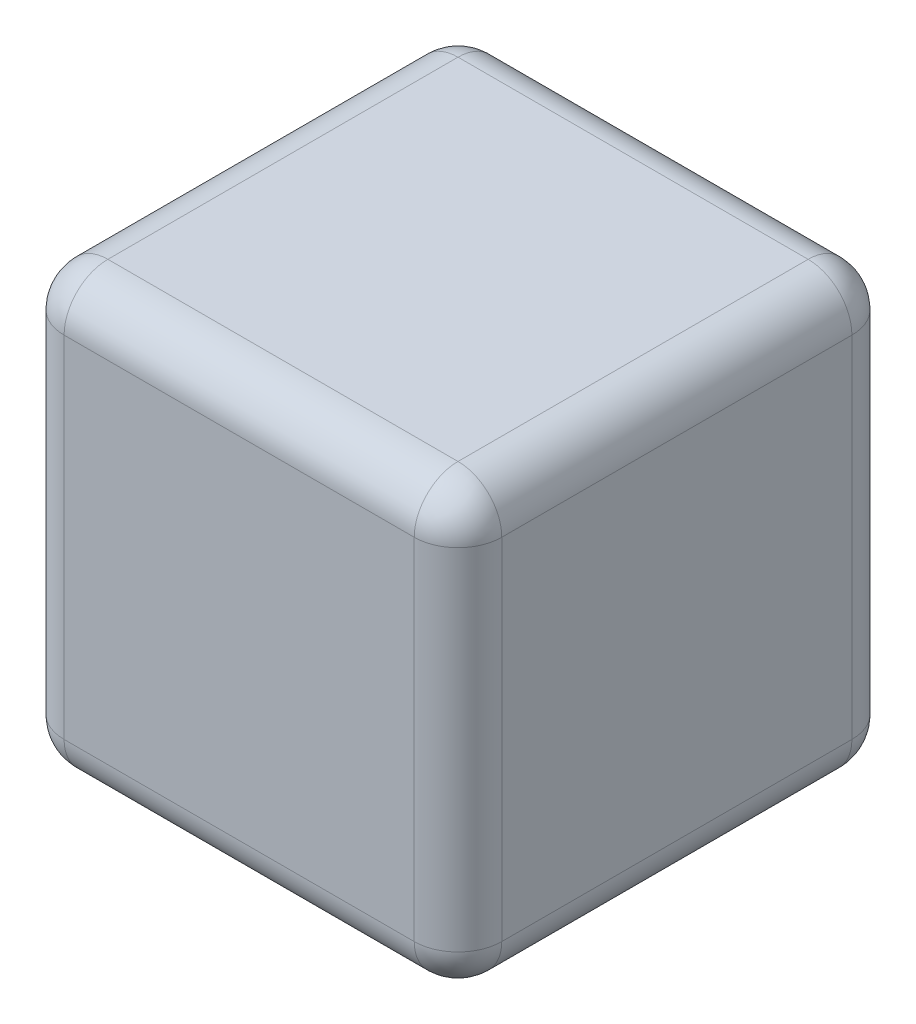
ISO-10303-21;
HEADER;
FILE_DESCRIPTION(('STEP AP214'),'2;1');
FILE_NAME('part.step','',(''),(''),'','','');
FILE_SCHEMA(('AUTOMOTIVE_DESIGN { 1 0 10303 214 1 1 1 1 }'));
ENDSEC;
DATA;
#1=APPLICATION_CONTEXT('core data for automotive mechanical design processes');
#2=APPLICATION_PROTOCOL_DEFINITION('international standard','automotive_design',2000,#1);
#3=PRODUCT_CONTEXT('',#1,'mechanical');
#4=PRODUCT('Part','Part','',(#3));
#5=PRODUCT_RELATED_PRODUCT_CATEGORY('part','',(#4));
#6=PRODUCT_DEFINITION_FORMATION('','',#4);
#7=PRODUCT_DEFINITION_CONTEXT('part definition',#1,'design');
#8=PRODUCT_DEFINITION('design','',#6,#7);
#9=PRODUCT_DEFINITION_SHAPE('','',#8);
#10=(LENGTH_UNIT() NAMED_UNIT(*) SI_UNIT(.MILLI.,.METRE.));
#11=(NAMED_UNIT(*) PLANE_ANGLE_UNIT() SI_UNIT($,.RADIAN.));
#12=(NAMED_UNIT(*) SI_UNIT($,.STERADIAN.) SOLID_ANGLE_UNIT());
#13=UNCERTAINTY_MEASURE_WITH_UNIT(LENGTH_MEASURE(1.E-05),#10,'distance_accuracy_value','');
#14=(GEOMETRIC_REPRESENTATION_CONTEXT(3) GLOBAL_UNCERTAINTY_ASSIGNED_CONTEXT((#13)) GLOBAL_UNIT_ASSIGNED_CONTEXT((#10,
#11,#12)) REPRESENTATION_CONTEXT('',''));
#15=CARTESIAN_POINT('',(0.,0.,0.));
#16=DIRECTION('',(0.,0.,1.));
#17=DIRECTION('',(1.,0.,0.));
#18=AXIS2_PLACEMENT_3D('',#15,#16,#17);
#19=CARTESIAN_POINT('',(2.5,5.,-2.5));
#20=DIRECTION('',(-1.,0.,0.));
#21=DIRECTION('',(0.,0.,1.));
#22=AXIS2_PLACEMENT_3D('',#19,#20,#21);
#23=PLANE('',#22);
#24=DIRECTION('',(0.,0.,-1.));
#25=VECTOR('',#24,1.);
#26=CARTESIAN_POINT('',(2.5,0.5,-2.5));
#27=LINE('',#26,#25);
#28=CARTESIAN_POINT('',(2.5,0.5,2.));
#29=VERTEX_POINT('',#28);
#30=CARTESIAN_POINT('',(2.5,0.5,-2.));
#31=VERTEX_POINT('',#30);
#32=EDGE_CURVE('E169',#29,#31,#27,.T.);
#33=ORIENTED_EDGE('',*,*,#32,.T.);
#34=DIRECTION('',(0.,-1.,0.));
#35=VECTOR('',#34,1.);
#36=CARTESIAN_POINT('',(2.5,5.,-2.));
#37=LINE('',#36,#35);
#38=CARTESIAN_POINT('',(2.5,4.5,-2.));
#39=VERTEX_POINT('',#38);
#40=EDGE_CURVE('E171',#31,#39,#37,.F.);
#41=ORIENTED_EDGE('',*,*,#40,.T.);
#42=DIRECTION('',(0.,0.,-1.));
#43=VECTOR('',#42,1.);
#44=CARTESIAN_POINT('',(2.5,4.5,2.5));
#45=LINE('',#44,#43);
#46=CARTESIAN_POINT('',(2.5,4.5,2.));
#47=VERTEX_POINT('',#46);
#48=EDGE_CURVE('E165',#39,#47,#45,.F.);
#49=ORIENTED_EDGE('',*,*,#48,.T.);
#50=DIRECTION('',(0.,-1.,0.));
#51=VECTOR('',#50,1.);
#52=CARTESIAN_POINT('',(2.5,5.,2.));
#53=LINE('',#52,#51);
#54=EDGE_CURVE('E167',#47,#29,#53,.T.);
#55=ORIENTED_EDGE('',*,*,#54,.T.);
#56=EDGE_LOOP('',(#33,#41,#49,#55));
#57=FACE_BOUND('',#56,.T.);
#58=ADVANCED_FACE('F34',(#57),#23,.F.);
#59=CARTESIAN_POINT('',(-2.5,5.,-2.5));
#60=DIRECTION('',(0.,0.,1.));
#61=DIRECTION('',(1.,0.,0.));
#62=AXIS2_PLACEMENT_3D('',#59,#60,#61);
#63=PLANE('',#62);
#64=DIRECTION('',(0.,-1.,0.));
#65=VECTOR('',#64,1.);
#66=CARTESIAN_POINT('',(2.,5.,-2.5));
#67=LINE('',#66,#65);
#68=CARTESIAN_POINT('',(2.,4.5,-2.5));
#69=VERTEX_POINT('',#68);
#70=CARTESIAN_POINT('',(2.,0.5,-2.5));
#71=VERTEX_POINT('',#70);
#72=EDGE_CURVE('E133',#69,#71,#67,.T.);
#73=ORIENTED_EDGE('',*,*,#72,.T.);
#74=DIRECTION('',(-1.,0.,0.));
#75=VECTOR('',#74,1.);
#76=CARTESIAN_POINT('',(-2.5,0.5,-2.5));
#77=LINE('',#76,#75);
#78=CARTESIAN_POINT('',(-2.,0.5,-2.5));
#79=VERTEX_POINT('',#78);
#80=EDGE_CURVE('E129',#71,#79,#77,.T.);
#81=ORIENTED_EDGE('',*,*,#80,.T.);
#82=DIRECTION('',(0.,-1.,0.));
#83=VECTOR('',#82,1.);
#84=CARTESIAN_POINT('',(-2.,5.,-2.5));
#85=LINE('',#84,#83);
#86=CARTESIAN_POINT('',(-2.,4.5,-2.5));
#87=VERTEX_POINT('',#86);
#88=EDGE_CURVE('E121',#79,#87,#85,.F.);
#89=ORIENTED_EDGE('',*,*,#88,.T.);
#90=DIRECTION('',(-1.,0.,0.));
#91=VECTOR('',#90,1.);
#92=CARTESIAN_POINT('',(2.5,4.5,-2.5));
#93=LINE('',#92,#91);
#94=EDGE_CURVE('E126',#87,#69,#93,.F.);
#95=ORIENTED_EDGE('',*,*,#94,.T.);
#96=EDGE_LOOP('',(#73,#81,#89,#95));
#97=FACE_BOUND('',#96,.T.);
#98=ADVANCED_FACE('F124',(#97),#63,.F.);
#99=CARTESIAN_POINT('',(-2.5,5.,-2.5));
#100=DIRECTION('',(1.,0.,0.));
#101=DIRECTION('',(0.,0.,-1.));
#102=AXIS2_PLACEMENT_3D('',#99,#100,#101);
#103=PLANE('',#102);
#104=DIRECTION('',(0.,0.,1.));
#105=VECTOR('',#104,1.);
#106=CARTESIAN_POINT('',(-2.5,4.5,-2.5));
#107=LINE('',#106,#105);
#108=CARTESIAN_POINT('',(-2.5,4.5,2.));
#109=VERTEX_POINT('',#108);
#110=CARTESIAN_POINT('',(-2.5,4.5,-2.));
#111=VERTEX_POINT('',#110);
#112=EDGE_CURVE('E174',#109,#111,#107,.F.);
#113=ORIENTED_EDGE('',*,*,#112,.T.);
#114=DIRECTION('',(0.,-1.,0.));
#115=VECTOR('',#114,1.);
#116=CARTESIAN_POINT('',(-2.5,5.,-2.));
#117=LINE('',#116,#115);
#118=CARTESIAN_POINT('',(-2.5,0.5,-2.));
#119=VERTEX_POINT('',#118);
#120=EDGE_CURVE('E141',#111,#119,#117,.T.);
#121=ORIENTED_EDGE('',*,*,#120,.T.);
#122=DIRECTION('',(0.,0.,1.));
#123=VECTOR('',#122,1.);
#124=CARTESIAN_POINT('',(-2.5,0.5,-2.5));
#125=LINE('',#124,#123);
#126=CARTESIAN_POINT('',(-2.5,0.5,2.));
#127=VERTEX_POINT('',#126);
#128=EDGE_CURVE('E178',#119,#127,#125,.T.);
#129=ORIENTED_EDGE('',*,*,#128,.T.);
#130=DIRECTION('',(0.,-1.,0.));
#131=VECTOR('',#130,1.);
#132=CARTESIAN_POINT('',(-2.5,5.,2.));
#133=LINE('',#132,#131);
#134=EDGE_CURVE('E176',#127,#109,#133,.F.);
#135=ORIENTED_EDGE('',*,*,#134,.T.);
#136=EDGE_LOOP('',(#113,#121,#129,#135));
#137=FACE_BOUND('',#136,.T.);
#138=ADVANCED_FACE('F298',(#137),#103,.F.);
#139=CARTESIAN_POINT('',(-2.5,5.,2.5));
#140=DIRECTION('',(0.,0.,-1.));
#141=DIRECTION('',(-1.,0.,0.));
#142=AXIS2_PLACEMENT_3D('',#139,#140,#141);
#143=PLANE('',#142);
#144=DIRECTION('',(1.,0.,0.));
#145=VECTOR('',#144,1.);
#146=CARTESIAN_POINT('',(-2.5,4.5,2.5));
#147=LINE('',#146,#145);
#148=CARTESIAN_POINT('',(2.,4.5,2.5));
#149=VERTEX_POINT('',#148);
#150=CARTESIAN_POINT('',(-2.,4.5,2.5));
#151=VERTEX_POINT('',#150);
#152=EDGE_CURVE('E190',#149,#151,#147,.F.);
#153=ORIENTED_EDGE('',*,*,#152,.T.);
#154=DIRECTION('',(0.,-1.,0.));
#155=VECTOR('',#154,1.);
#156=CARTESIAN_POINT('',(-2.,5.,2.5));
#157=LINE('',#156,#155);
#158=CARTESIAN_POINT('',(-2.,0.5,2.5));
#159=VERTEX_POINT('',#158);
#160=EDGE_CURVE('E196',#151,#159,#157,.T.);
#161=ORIENTED_EDGE('',*,*,#160,.T.);
#162=DIRECTION('',(1.,0.,0.));
#163=VECTOR('',#162,1.);
#164=CARTESIAN_POINT('',(-2.5,0.5,2.5));
#165=LINE('',#164,#163);
#166=CARTESIAN_POINT('',(2.,0.5,2.5));
#167=VERTEX_POINT('',#166);
#168=EDGE_CURVE('E194',#159,#167,#165,.T.);
#169=ORIENTED_EDGE('',*,*,#168,.T.);
#170=DIRECTION('',(0.,-1.,0.));
#171=VECTOR('',#170,1.);
#172=CARTESIAN_POINT('',(2.,5.,2.5));
#173=LINE('',#172,#171);
#174=EDGE_CURVE('E192',#167,#149,#173,.F.);
#175=ORIENTED_EDGE('',*,*,#174,.T.);
#176=EDGE_LOOP('',(#153,#161,#169,#175));
#177=FACE_BOUND('',#176,.T.);
#178=ADVANCED_FACE('F275',(#177),#143,.F.);
#179=CARTESIAN_POINT('',(0.,5.,0.));
#180=DIRECTION('',(0.,1.,0.));
#181=DIRECTION('',(0.,0.,1.));
#182=AXIS2_PLACEMENT_3D('',#179,#180,#181);
#183=PLANE('',#182);
#184=DIRECTION('',(-1.,0.,0.));
#185=VECTOR('',#184,1.);
#186=CARTESIAN_POINT('',(-2.5,5.,-2.));
#187=LINE('',#186,#185);
#188=CARTESIAN_POINT('',(2.,5.,-2.));
#189=VERTEX_POINT('',#188);
#190=CARTESIAN_POINT('',(-2.,5.,-2.));
#191=VERTEX_POINT('',#190);
#192=EDGE_CURVE('E43',#189,#191,#187,.T.);
#193=ORIENTED_EDGE('',*,*,#192,.T.);
#194=DIRECTION('',(0.,0.,1.));
#195=VECTOR('',#194,1.);
#196=CARTESIAN_POINT('',(-2.,5.,2.5));
#197=LINE('',#196,#195);
#198=CARTESIAN_POINT('',(-2.,5.,2.));
#199=VERTEX_POINT('',#198);
#200=EDGE_CURVE('E11',#191,#199,#197,.T.);
#201=ORIENTED_EDGE('',*,*,#200,.T.);
#202=DIRECTION('',(1.,0.,0.));
#203=VECTOR('',#202,1.);
#204=CARTESIAN_POINT('',(2.5,5.,2.));
#205=LINE('',#204,#203);
#206=CARTESIAN_POINT('',(2.,5.,2.));
#207=VERTEX_POINT('',#206);
#208=EDGE_CURVE('E199',#199,#207,#205,.T.);
#209=ORIENTED_EDGE('',*,*,#208,.T.);
#210=DIRECTION('',(0.,0.,-1.));
#211=VECTOR('',#210,1.);
#212=CARTESIAN_POINT('',(2.,5.,-2.5));
#213=LINE('',#212,#211);
#214=EDGE_CURVE('E54',#207,#189,#213,.T.);
#215=ORIENTED_EDGE('',*,*,#214,.T.);
#216=EDGE_LOOP('',(#193,#201,#209,#215));
#217=FACE_BOUND('',#216,.T.);
#218=ADVANCED_FACE('F305',(#217),#183,.T.);
#219=CARTESIAN_POINT('',(0.,0.,0.));
#220=DIRECTION('',(0.,1.,0.));
#221=DIRECTION('',(0.,0.,1.));
#222=AXIS2_PLACEMENT_3D('',#219,#220,#221);
#223=PLANE('',#222);
#224=DIRECTION('',(0.,0.,1.));
#225=VECTOR('',#224,1.);
#226=CARTESIAN_POINT('',(-2.,0.,0.));
#227=LINE('',#226,#225);
#228=CARTESIAN_POINT('',(-2.,0.,2.));
#229=VERTEX_POINT('',#228);
#230=CARTESIAN_POINT('',(-2.,0.,-2.));
#231=VERTEX_POINT('',#230);
#232=EDGE_CURVE('E185',#229,#231,#227,.F.);
#233=ORIENTED_EDGE('',*,*,#232,.T.);
#234=DIRECTION('',(-1.,0.,0.));
#235=VECTOR('',#234,1.);
#236=CARTESIAN_POINT('',(0.,0.,-2.));
#237=LINE('',#236,#235);
#238=CARTESIAN_POINT('',(2.,0.,-2.));
#239=VERTEX_POINT('',#238);
#240=EDGE_CURVE('E187',#231,#239,#237,.F.);
#241=ORIENTED_EDGE('',*,*,#240,.T.);
#242=DIRECTION('',(0.,0.,-1.));
#243=VECTOR('',#242,1.);
#244=CARTESIAN_POINT('',(2.,0.,0.));
#245=LINE('',#244,#243);
#246=CARTESIAN_POINT('',(2.,0.,2.));
#247=VERTEX_POINT('',#246);
#248=EDGE_CURVE('E183',#239,#247,#245,.F.);
#249=ORIENTED_EDGE('',*,*,#248,.T.);
#250=DIRECTION('',(1.,0.,0.));
#251=VECTOR('',#250,1.);
#252=CARTESIAN_POINT('',(0.,0.,2.));
#253=LINE('',#252,#251);
#254=EDGE_CURVE('E181',#247,#229,#253,.F.);
#255=ORIENTED_EDGE('',*,*,#254,.T.);
#256=EDGE_LOOP('',(#233,#241,#249,#255));
#257=FACE_BOUND('',#256,.T.);
#258=ADVANCED_FACE('F266',(#257),#223,.F.);
#259=CARTESIAN_POINT('',(-2.,5.,2.));
#260=DIRECTION('',(0.,-1.,0.));
#261=DIRECTION('',(0.,0.,-1.));
#262=AXIS2_PLACEMENT_3D('',#259,#260,#261);
#263=CYLINDRICAL_SURFACE('',#262,0.5);
#264=CARTESIAN_POINT('',(-2.,4.5,2.));
#265=DIRECTION('',(0.,1.,0.));
#266=DIRECTION('',(0.,0.,1.));
#267=AXIS2_PLACEMENT_3D('',#264,#265,#266);
#268=CIRCLE('',#267,0.5);
#269=EDGE_CURVE('E38',#109,#151,#268,.T.);
#270=ORIENTED_EDGE('',*,*,#269,.F.);
#271=ORIENTED_EDGE('',*,*,#134,.F.);
#272=CARTESIAN_POINT('',(-2.,0.5,2.));
#273=DIRECTION('',(0.,-1.,0.));
#274=DIRECTION('',(0.,0.,-1.));
#275=AXIS2_PLACEMENT_3D('',#272,#273,#274);
#276=CIRCLE('',#275,0.5);
#277=EDGE_CURVE('E161',#159,#127,#276,.T.);
#278=ORIENTED_EDGE('',*,*,#277,.F.);
#279=ORIENTED_EDGE('',*,*,#160,.F.);
#280=EDGE_LOOP('',(#270,#271,#278,#279));
#281=FACE_BOUND('',#280,.T.);
#282=ADVANCED_FACE('F36',(#281),#263,.T.);
#283=CARTESIAN_POINT('',(-2.,4.5,2.));
#284=DIRECTION('',(0.,0.,1.));
#285=DIRECTION('',(1.,0.,0.));
#286=AXIS2_PLACEMENT_3D('',#283,#284,#285);
#287=SPHERICAL_SURFACE('',#286,0.5);
#288=CARTESIAN_POINT('',(-2.,4.5,2.));
#289=DIRECTION('',(0.,0.,1.));
#290=DIRECTION('',(1.,0.,0.));
#291=AXIS2_PLACEMENT_3D('',#288,#289,#290);
#292=CIRCLE('',#291,0.5);
#293=EDGE_CURVE('E245',#109,#199,#292,.F.);
#294=ORIENTED_EDGE('',*,*,#293,.F.);
#295=ORIENTED_EDGE('',*,*,#269,.T.);
#296=CARTESIAN_POINT('',(-2.,4.5,2.));
#297=DIRECTION('',(-1.,0.,0.));
#298=DIRECTION('',(0.,0.,1.));
#299=AXIS2_PLACEMENT_3D('',#296,#297,#298);
#300=CIRCLE('',#299,0.5);
#301=EDGE_CURVE('E248',#199,#151,#300,.F.);
#302=ORIENTED_EDGE('',*,*,#301,.F.);
#303=EDGE_LOOP('',(#294,#295,#302));
#304=FACE_BOUND('',#303,.T.);
#305=ADVANCED_FACE('F293',(#304),#287,.T.);
#306=CARTESIAN_POINT('',(-2.,0.5,2.));
#307=DIRECTION('',(0.,0.,1.));
#308=DIRECTION('',(1.,0.,0.));
#309=AXIS2_PLACEMENT_3D('',#306,#307,#308);
#310=SPHERICAL_SURFACE('',#309,0.5);
#311=CARTESIAN_POINT('',(-2.,0.5,2.));
#312=DIRECTION('',(-1.,0.,0.));
#313=DIRECTION('',(0.,0.,1.));
#314=AXIS2_PLACEMENT_3D('',#311,#312,#313);
#315=CIRCLE('',#314,0.5);
#316=EDGE_CURVE('E239',#159,#229,#315,.F.);
#317=ORIENTED_EDGE('',*,*,#316,.F.);
#318=ORIENTED_EDGE('',*,*,#277,.T.);
#319=CARTESIAN_POINT('',(-2.,0.5,2.));
#320=DIRECTION('',(0.,0.,1.));
#321=DIRECTION('',(1.,0.,0.));
#322=AXIS2_PLACEMENT_3D('',#319,#320,#321);
#323=CIRCLE('',#322,0.5);
#324=EDGE_CURVE('E242',#229,#127,#323,.F.);
#325=ORIENTED_EDGE('',*,*,#324,.F.);
#326=EDGE_LOOP('',(#317,#318,#325));
#327=FACE_BOUND('',#326,.T.);
#328=ADVANCED_FACE('F255',(#327),#310,.T.);
#329=CARTESIAN_POINT('',(0.,4.5,2.));
#330=DIRECTION('',(-1.,0.,0.));
#331=DIRECTION('',(0.,0.,1.));
#332=AXIS2_PLACEMENT_3D('',#329,#330,#331);
#333=CYLINDRICAL_SURFACE('',#332,0.5);
#334=ORIENTED_EDGE('',*,*,#301,.T.);
#335=ORIENTED_EDGE('',*,*,#152,.F.);
#336=CARTESIAN_POINT('',(2.,4.5,2.));
#337=DIRECTION('',(1.,0.,0.));
#338=DIRECTION('',(0.,0.,-1.));
#339=AXIS2_PLACEMENT_3D('',#336,#337,#338);
#340=CIRCLE('',#339,0.5);
#341=EDGE_CURVE('E233',#207,#149,#340,.T.);
#342=ORIENTED_EDGE('',*,*,#341,.F.);
#343=ORIENTED_EDGE('',*,*,#208,.F.);
#344=EDGE_LOOP('',(#334,#335,#342,#343));
#345=FACE_BOUND('',#344,.T.);
#346=ADVANCED_FACE('F288',(#345),#333,.T.);
#347=CARTESIAN_POINT('',(-2.,4.5,0.));
#348=DIRECTION('',(0.,0.,-1.));
#349=DIRECTION('',(-1.,0.,0.));
#350=AXIS2_PLACEMENT_3D('',#347,#348,#349);
#351=CYLINDRICAL_SURFACE('',#350,0.5);
#352=ORIENTED_EDGE('',*,*,#293,.T.);
#353=ORIENTED_EDGE('',*,*,#200,.F.);
#354=CARTESIAN_POINT('',(-2.,4.5,-2.));
#355=DIRECTION('',(0.,0.,-1.));
#356=DIRECTION('',(-1.,0.,0.));
#357=AXIS2_PLACEMENT_3D('',#354,#355,#356);
#358=CIRCLE('',#357,0.5);
#359=EDGE_CURVE('E145',#111,#191,#358,.T.);
#360=ORIENTED_EDGE('',*,*,#359,.F.);
#361=ORIENTED_EDGE('',*,*,#112,.F.);
#362=EDGE_LOOP('',(#352,#353,#360,#361));
#363=FACE_BOUND('',#362,.T.);
#364=ADVANCED_FACE('F296',(#363),#351,.T.);
#365=CARTESIAN_POINT('',(-2.,5.,-2.));
#366=DIRECTION('',(0.,-1.,0.));
#367=DIRECTION('',(0.,0.,-1.));
#368=AXIS2_PLACEMENT_3D('',#365,#366,#367);
#369=CYLINDRICAL_SURFACE('',#368,0.5);
#370=CARTESIAN_POINT('',(-2.,0.5,-2.));
#371=DIRECTION('',(0.,-1.,0.));
#372=DIRECTION('',(0.,0.,-1.));
#373=AXIS2_PLACEMENT_3D('',#370,#371,#372);
#374=CIRCLE('',#373,0.5);
#375=EDGE_CURVE('E146',#119,#79,#374,.T.);
#376=ORIENTED_EDGE('',*,*,#375,.F.);
#377=ORIENTED_EDGE('',*,*,#120,.F.);
#378=CARTESIAN_POINT('',(-2.,4.5,-2.));
#379=DIRECTION('',(0.,1.,0.));
#380=DIRECTION('',(0.,0.,1.));
#381=AXIS2_PLACEMENT_3D('',#378,#379,#380);
#382=CIRCLE('',#381,0.5);
#383=EDGE_CURVE('E137',#87,#111,#382,.T.);
#384=ORIENTED_EDGE('',*,*,#383,.F.);
#385=ORIENTED_EDGE('',*,*,#88,.F.);
#386=EDGE_LOOP('',(#376,#377,#384,#385));
#387=FACE_BOUND('',#386,.T.);
#388=ADVANCED_FACE('F139',(#387),#369,.T.);
#389=CARTESIAN_POINT('',(-2.,0.5,-2.5));
#390=DIRECTION('',(0.,0.,1.));
#391=DIRECTION('',(1.,0.,0.));
#392=AXIS2_PLACEMENT_3D('',#389,#390,#391);
#393=CYLINDRICAL_SURFACE('',#392,0.5);
#394=ORIENTED_EDGE('',*,*,#324,.T.);
#395=ORIENTED_EDGE('',*,*,#128,.F.);
#396=CARTESIAN_POINT('',(-2.,0.5,-2.));
#397=DIRECTION('',(0.,0.,-1.));
#398=DIRECTION('',(-1.,0.,0.));
#399=AXIS2_PLACEMENT_3D('',#396,#397,#398);
#400=CIRCLE('',#399,0.5);
#401=EDGE_CURVE('E229',#231,#119,#400,.T.);
#402=ORIENTED_EDGE('',*,*,#401,.F.);
#403=ORIENTED_EDGE('',*,*,#232,.F.);
#404=EDGE_LOOP('',(#394,#395,#402,#403));
#405=FACE_BOUND('',#404,.T.);
#406=ADVANCED_FACE('F262',(#405),#393,.T.);
#407=CARTESIAN_POINT('',(-2.5,0.5,2.));
#408=DIRECTION('',(1.,0.,0.));
#409=DIRECTION('',(0.,0.,-1.));
#410=AXIS2_PLACEMENT_3D('',#407,#408,#409);
#411=CYLINDRICAL_SURFACE('',#410,0.5);
#412=ORIENTED_EDGE('',*,*,#316,.T.);
#413=ORIENTED_EDGE('',*,*,#254,.F.);
#414=CARTESIAN_POINT('',(2.,0.5,2.));
#415=DIRECTION('',(1.,0.,0.));
#416=DIRECTION('',(0.,0.,-1.));
#417=AXIS2_PLACEMENT_3D('',#414,#415,#416);
#418=CIRCLE('',#417,0.5);
#419=EDGE_CURVE('E226',#167,#247,#418,.T.);
#420=ORIENTED_EDGE('',*,*,#419,.F.);
#421=ORIENTED_EDGE('',*,*,#168,.F.);
#422=EDGE_LOOP('',(#412,#413,#420,#421));
#423=FACE_BOUND('',#422,.T.);
#424=ADVANCED_FACE('F272',(#423),#411,.T.);
#425=CARTESIAN_POINT('',(2.,5.,2.));
#426=DIRECTION('',(0.,-1.,0.));
#427=DIRECTION('',(0.,0.,-1.));
#428=AXIS2_PLACEMENT_3D('',#425,#426,#427);
#429=CYLINDRICAL_SURFACE('',#428,0.5);
#430=CARTESIAN_POINT('',(2.,4.5,2.));
#431=DIRECTION('',(0.,1.,0.));
#432=DIRECTION('',(0.,0.,1.));
#433=AXIS2_PLACEMENT_3D('',#430,#431,#432);
#434=CIRCLE('',#433,0.5);
#435=EDGE_CURVE('E236',#149,#47,#434,.T.);
#436=ORIENTED_EDGE('',*,*,#435,.F.);
#437=ORIENTED_EDGE('',*,*,#174,.F.);
#438=CARTESIAN_POINT('',(2.,0.5,2.));
#439=DIRECTION('',(0.,-1.,0.));
#440=DIRECTION('',(0.,0.,-1.));
#441=AXIS2_PLACEMENT_3D('',#438,#439,#440);
#442=CIRCLE('',#441,0.5);
#443=EDGE_CURVE('E223',#29,#167,#442,.T.);
#444=ORIENTED_EDGE('',*,*,#443,.F.);
#445=ORIENTED_EDGE('',*,*,#54,.F.);
#446=EDGE_LOOP('',(#436,#437,#444,#445));
#447=FACE_BOUND('',#446,.T.);
#448=ADVANCED_FACE('F280',(#447),#429,.T.);
#449=CARTESIAN_POINT('',(2.,4.5,2.));
#450=DIRECTION('',(0.,0.,1.));
#451=DIRECTION('',(1.,0.,0.));
#452=AXIS2_PLACEMENT_3D('',#449,#450,#451);
#453=SPHERICAL_SURFACE('',#452,0.5);
#454=ORIENTED_EDGE('',*,*,#341,.T.);
#455=ORIENTED_EDGE('',*,*,#435,.T.);
#456=CARTESIAN_POINT('',(2.,4.5,2.));
#457=DIRECTION('',(0.,0.,1.));
#458=DIRECTION('',(0.,-1.,0.));
#459=AXIS2_PLACEMENT_3D('',#456,#457,#458);
#460=CIRCLE('',#459,0.5);
#461=EDGE_CURVE('E152',#207,#47,#460,.F.);
#462=ORIENTED_EDGE('',*,*,#461,.F.);
#463=EDGE_LOOP('',(#454,#455,#462));
#464=FACE_BOUND('',#463,.T.);
#465=ADVANCED_FACE('F286',(#464),#453,.T.);
#466=CARTESIAN_POINT('',(-2.,4.5,-2.));
#467=DIRECTION('',(0.,0.,1.));
#468=DIRECTION('',(1.,0.,0.));
#469=AXIS2_PLACEMENT_3D('',#466,#467,#468);
#470=SPHERICAL_SURFACE('',#469,0.5);
#471=ORIENTED_EDGE('',*,*,#383,.T.);
#472=ORIENTED_EDGE('',*,*,#359,.T.);
#473=CARTESIAN_POINT('',(-2.,4.5,-2.));
#474=DIRECTION('',(-1.,0.,0.));
#475=DIRECTION('',(0.,0.,1.));
#476=AXIS2_PLACEMENT_3D('',#473,#474,#475);
#477=CIRCLE('',#476,0.5);
#478=EDGE_CURVE('E149',#87,#191,#477,.F.);
#479=ORIENTED_EDGE('',*,*,#478,.F.);
#480=EDGE_LOOP('',(#471,#472,#479));
#481=FACE_BOUND('',#480,.T.);
#482=ADVANCED_FACE('F150',(#481),#470,.T.);
#483=CARTESIAN_POINT('',(-2.,0.5,-2.));
#484=DIRECTION('',(0.,0.,1.));
#485=DIRECTION('',(1.,0.,0.));
#486=AXIS2_PLACEMENT_3D('',#483,#484,#485);
#487=SPHERICAL_SURFACE('',#486,0.5);
#488=ORIENTED_EDGE('',*,*,#401,.T.);
#489=ORIENTED_EDGE('',*,*,#375,.T.);
#490=CARTESIAN_POINT('',(-2.,0.5,-2.));
#491=DIRECTION('',(-1.,0.,0.));
#492=DIRECTION('',(0.,0.,1.));
#493=AXIS2_PLACEMENT_3D('',#490,#491,#492);
#494=CIRCLE('',#493,0.5);
#495=EDGE_CURVE('E153',#231,#79,#494,.F.);
#496=ORIENTED_EDGE('',*,*,#495,.F.);
#497=EDGE_LOOP('',(#488,#489,#496));
#498=FACE_BOUND('',#497,.T.);
#499=ADVANCED_FACE('F343',(#498),#487,.T.);
#500=CARTESIAN_POINT('',(2.,0.5,2.));
#501=DIRECTION('',(0.,0.,1.));
#502=DIRECTION('',(1.,0.,0.));
#503=AXIS2_PLACEMENT_3D('',#500,#501,#502);
#504=SPHERICAL_SURFACE('',#503,0.5);
#505=ORIENTED_EDGE('',*,*,#443,.T.);
#506=ORIENTED_EDGE('',*,*,#419,.T.);
#507=CARTESIAN_POINT('',(2.,0.5,2.));
#508=DIRECTION('',(0.,0.,1.));
#509=DIRECTION('',(1.,0.,0.));
#510=AXIS2_PLACEMENT_3D('',#507,#508,#509);
#511=CIRCLE('',#510,0.5);
#512=EDGE_CURVE('E216',#29,#247,#511,.F.);
#513=ORIENTED_EDGE('',*,*,#512,.F.);
#514=EDGE_LOOP('',(#505,#506,#513));
#515=FACE_BOUND('',#514,.T.);
#516=ADVANCED_FACE('F339',(#515),#504,.T.);
#517=CARTESIAN_POINT('',(2.,4.5,0.));
#518=DIRECTION('',(0.,0.,1.));
#519=DIRECTION('',(1.,0.,0.));
#520=AXIS2_PLACEMENT_3D('',#517,#518,#519);
#521=CYLINDRICAL_SURFACE('',#520,0.5);
#522=ORIENTED_EDGE('',*,*,#461,.T.);
#523=ORIENTED_EDGE('',*,*,#48,.F.);
#524=CARTESIAN_POINT('',(2.,4.5,-2.));
#525=DIRECTION('',(0.,0.,-1.));
#526=DIRECTION('',(-1.,0.,0.));
#527=AXIS2_PLACEMENT_3D('',#524,#525,#526);
#528=CIRCLE('',#527,0.5);
#529=EDGE_CURVE('E213',#189,#39,#528,.T.);
#530=ORIENTED_EDGE('',*,*,#529,.F.);
#531=ORIENTED_EDGE('',*,*,#214,.F.);
#532=EDGE_LOOP('',(#522,#523,#530,#531));
#533=FACE_BOUND('',#532,.T.);
#534=ADVANCED_FACE('F336',(#533),#521,.T.);
#535=CARTESIAN_POINT('',(0.,4.5,-2.));
#536=DIRECTION('',(1.,0.,0.));
#537=DIRECTION('',(0.,0.,-1.));
#538=AXIS2_PLACEMENT_3D('',#535,#536,#537);
#539=CYLINDRICAL_SURFACE('',#538,0.5);
#540=ORIENTED_EDGE('',*,*,#478,.T.);
#541=ORIENTED_EDGE('',*,*,#192,.F.);
#542=CARTESIAN_POINT('',(2.,4.5,-2.));
#543=DIRECTION('',(1.,0.,0.));
#544=DIRECTION('',(0.,1.,0.));
#545=AXIS2_PLACEMENT_3D('',#542,#543,#544);
#546=CIRCLE('',#545,0.5);
#547=EDGE_CURVE('E157',#69,#189,#546,.T.);
#548=ORIENTED_EDGE('',*,*,#547,.F.);
#549=ORIENTED_EDGE('',*,*,#94,.F.);
#550=EDGE_LOOP('',(#540,#541,#548,#549));
#551=FACE_BOUND('',#550,.T.);
#552=ADVANCED_FACE('F155',(#551),#539,.T.);
#553=CARTESIAN_POINT('',(-2.5,0.5,-2.));
#554=DIRECTION('',(-1.,0.,0.));
#555=DIRECTION('',(0.,0.,1.));
#556=AXIS2_PLACEMENT_3D('',#553,#554,#555);
#557=CYLINDRICAL_SURFACE('',#556,0.5);
#558=ORIENTED_EDGE('',*,*,#495,.T.);
#559=ORIENTED_EDGE('',*,*,#80,.F.);
#560=CARTESIAN_POINT('',(2.,0.5,-2.));
#561=DIRECTION('',(1.,0.,0.));
#562=DIRECTION('',(0.,0.,-1.));
#563=AXIS2_PLACEMENT_3D('',#560,#561,#562);
#564=CIRCLE('',#563,0.5);
#565=EDGE_CURVE('E209',#239,#71,#564,.T.);
#566=ORIENTED_EDGE('',*,*,#565,.F.);
#567=ORIENTED_EDGE('',*,*,#240,.F.);
#568=EDGE_LOOP('',(#558,#559,#566,#567));
#569=FACE_BOUND('',#568,.T.);
#570=ADVANCED_FACE('F329',(#569),#557,.T.);
#571=CARTESIAN_POINT('',(2.,0.5,-2.5));
#572=DIRECTION('',(0.,0.,-1.));
#573=DIRECTION('',(-1.,0.,0.));
#574=AXIS2_PLACEMENT_3D('',#571,#572,#573);
#575=CYLINDRICAL_SURFACE('',#574,0.5);
#576=ORIENTED_EDGE('',*,*,#512,.T.);
#577=ORIENTED_EDGE('',*,*,#248,.F.);
#578=CARTESIAN_POINT('',(2.,0.5,-2.));
#579=DIRECTION('',(0.,0.,-1.));
#580=DIRECTION('',(-1.,0.,0.));
#581=AXIS2_PLACEMENT_3D('',#578,#579,#580);
#582=CIRCLE('',#581,0.5);
#583=EDGE_CURVE('E207',#31,#239,#582,.T.);
#584=ORIENTED_EDGE('',*,*,#583,.F.);
#585=ORIENTED_EDGE('',*,*,#32,.F.);
#586=EDGE_LOOP('',(#576,#577,#584,#585));
#587=FACE_BOUND('',#586,.T.);
#588=ADVANCED_FACE('F325',(#587),#575,.T.);
#589=CARTESIAN_POINT('',(2.,4.5,-2.));
#590=DIRECTION('',(0.,0.,1.));
#591=DIRECTION('',(1.,0.,0.));
#592=AXIS2_PLACEMENT_3D('',#589,#590,#591);
#593=SPHERICAL_SURFACE('',#592,0.5);
#594=ORIENTED_EDGE('',*,*,#547,.T.);
#595=ORIENTED_EDGE('',*,*,#529,.T.);
#596=CARTESIAN_POINT('',(2.,4.5,-2.));
#597=DIRECTION('',(0.,1.,0.));
#598=DIRECTION('',(0.,0.,1.));
#599=AXIS2_PLACEMENT_3D('',#596,#597,#598);
#600=CIRCLE('',#599,0.5);
#601=EDGE_CURVE('E205',#69,#39,#600,.F.);
#602=ORIENTED_EDGE('',*,*,#601,.F.);
#603=EDGE_LOOP('',(#594,#595,#602));
#604=FACE_BOUND('',#603,.T.);
#605=ADVANCED_FACE('F321',(#604),#593,.T.);
#606=CARTESIAN_POINT('',(2.,0.5,-2.));
#607=DIRECTION('',(0.,0.,1.));
#608=DIRECTION('',(1.,0.,0.));
#609=AXIS2_PLACEMENT_3D('',#606,#607,#608);
#610=SPHERICAL_SURFACE('',#609,0.5);
#611=ORIENTED_EDGE('',*,*,#583,.T.);
#612=ORIENTED_EDGE('',*,*,#565,.T.);
#613=CARTESIAN_POINT('',(2.,0.5,-2.));
#614=DIRECTION('',(0.,-1.,0.));
#615=DIRECTION('',(0.,0.,-1.));
#616=AXIS2_PLACEMENT_3D('',#613,#614,#615);
#617=CIRCLE('',#616,0.5);
#618=EDGE_CURVE('E203',#31,#71,#617,.F.);
#619=ORIENTED_EDGE('',*,*,#618,.F.);
#620=EDGE_LOOP('',(#611,#612,#619));
#621=FACE_BOUND('',#620,.T.);
#622=ADVANCED_FACE('F317',(#621),#610,.T.);
#623=CARTESIAN_POINT('',(2.,5.,-2.));
#624=DIRECTION('',(0.,-1.,0.));
#625=DIRECTION('',(0.,0.,-1.));
#626=AXIS2_PLACEMENT_3D('',#623,#624,#625);
#627=CYLINDRICAL_SURFACE('',#626,0.5);
#628=ORIENTED_EDGE('',*,*,#601,.T.);
#629=ORIENTED_EDGE('',*,*,#40,.F.);
#630=ORIENTED_EDGE('',*,*,#618,.T.);
#631=ORIENTED_EDGE('',*,*,#72,.F.);
#632=EDGE_LOOP('',(#628,#629,#630,#631));
#633=FACE_BOUND('',#632,.T.);
#634=ADVANCED_FACE('F314',(#633),#627,.T.);
#635=CLOSED_SHELL('',(#58,#98,#138,#178,#218,#258,#282,#305,#328,#346,#364,#388,#406,#424,#448,
#465,#482,#499,#516,#534,#552,#570,#588,#605,#622,#634));
#636=MANIFOLD_SOLID_BREP('B2',#635);
#637=ADVANCED_BREP_SHAPE_REPRESENTATION('',(#18,#636),#14);
#638=SHAPE_DEFINITION_REPRESENTATION(#9,#637);
ENDSEC;
END-ISO-10303-21;
